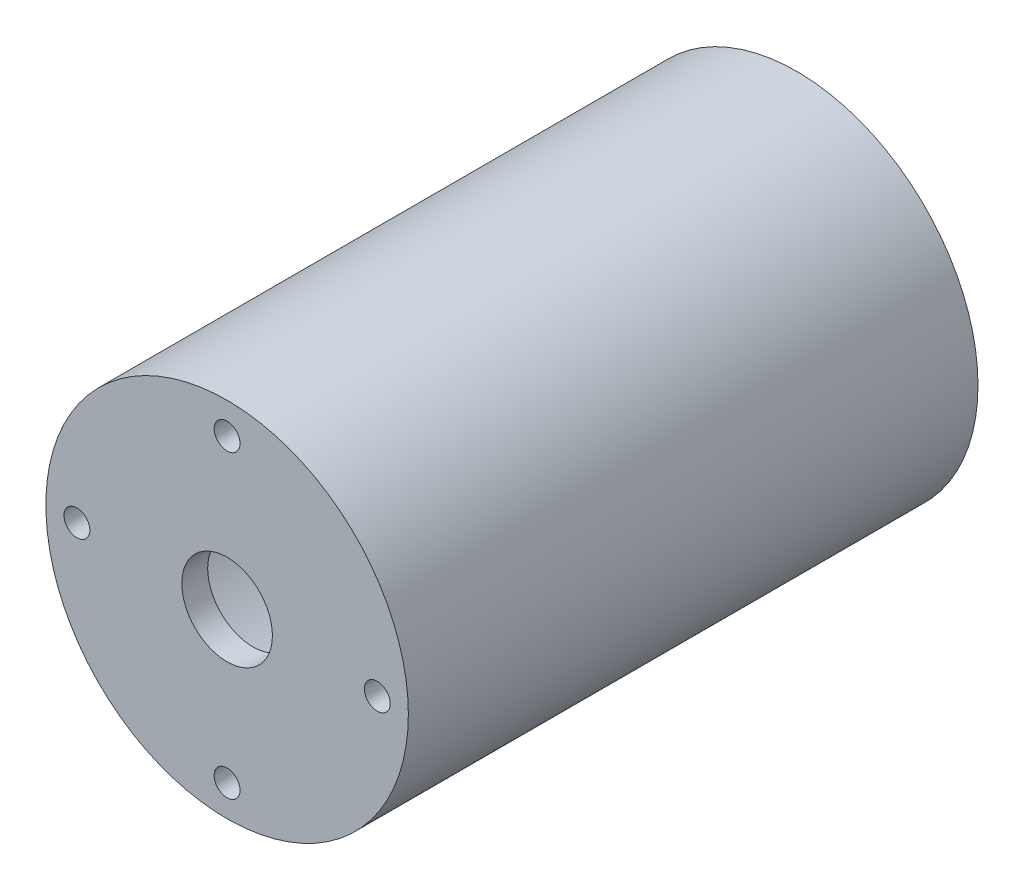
from build123d import *

# Parameters (mm, degrees)
CROQUIS1_R              = 70
SALIENTE_EXTRUIR1_DEPTH = 220
CROQUIS2_R              = 65
CORTAR_EXTRUIR1_DEPTH   = 210
CORTAR_EXTRUIR2_REACH   = 243.247
CROQUIS3_R              = 5
CORTAR_EXTRUIR3_REACH   = 243.247
CROQUIS4_R              = 17.5


with BuildPart() as part:
    # Croquis1 → Saliente-Extruir1 (new body)
    with BuildSketch(Plane.XY):
        Circle(CROQUIS1_R)
    extrude(amount=SALIENTE_EXTRUIR1_DEPTH)

    # Croquis2 → Cortar-Extruir1 (cut)
    with BuildSketch(Plane(origin=(0, 0, 0), x_dir=(-1, 0, 0), z_dir=(0, 0, -1))):
        Circle(CROQUIS2_R)
    extrude(amount=-CORTAR_EXTRUIR1_DEPTH, mode=Mode.SUBTRACT)

    # Croquis3 → Cortar-Extruir2 (cut, up to next)
    with BuildSketch(Plane.XY.offset(220), mode=Mode.PRIVATE) as cortar_extruir2_sk1:
        with Locations((0, 58)):
            Circle(CROQUIS3_R)
    cortar_extruir2_tool1 = extrude(cortar_extruir2_sk1.sketch, amount=-CORTAR_EXTRUIR2_REACH, mode=Mode.PRIVATE) & part.part
    # Croquis3 → Cortar-Extruir2 (cut, up to next)
    with BuildSketch(Plane.XY.offset(220), mode=Mode.PRIVATE) as cortar_extruir2_sk2:
        with Locations((58, 0)):
            Circle(CROQUIS3_R)
    cortar_extruir2_tool2 = extrude(cortar_extruir2_sk2.sketch, amount=-CORTAR_EXTRUIR2_REACH, mode=Mode.PRIVATE) & part.part
    # Croquis3 → Cortar-Extruir2 (cut, up to next)
    with BuildSketch(Plane.XY.offset(220), mode=Mode.PRIVATE) as cortar_extruir2_sk3:
        with Locations((0, -58)):
            Circle(CROQUIS3_R)
    cortar_extruir2_tool3 = extrude(cortar_extruir2_sk3.sketch, amount=-CORTAR_EXTRUIR2_REACH, mode=Mode.PRIVATE) & part.part
    # Croquis3 → Cortar-Extruir2 (cut, up to next)
    with BuildSketch(Plane.XY.offset(220), mode=Mode.PRIVATE) as cortar_extruir2_sk4:
        with Locations((-58, 0)):
            Circle(CROQUIS3_R)
    cortar_extruir2_tool4 = extrude(cortar_extruir2_sk4.sketch, amount=-CORTAR_EXTRUIR2_REACH, mode=Mode.PRIVATE) & part.part
    add(cortar_extruir2_tool1.solids().sort_by_distance((0, 58, 220))[0], mode=Mode.SUBTRACT)
    add(cortar_extruir2_tool2.solids().sort_by_distance((58, 0, 220))[0], mode=Mode.SUBTRACT)
    add(cortar_extruir2_tool3.solids().sort_by_distance((0, -58, 220))[0], mode=Mode.SUBTRACT)
    add(cortar_extruir2_tool4.solids().sort_by_distance((-58, 0, 220))[0], mode=Mode.SUBTRACT)

    # Croquis4 → Cortar-Extruir3 (cut, up to next)
    with BuildSketch(Plane.XY.offset(220), mode=Mode.PRIVATE) as cortar_extruir3_sk1:
        Circle(CROQUIS4_R)
    cortar_extruir3_tool1 = extrude(cortar_extruir3_sk1.sketch, amount=-CORTAR_EXTRUIR3_REACH, mode=Mode.PRIVATE) & part.part
    add(cortar_extruir3_tool1.solids().sort_by_distance((0, 0, 220))[0], mode=Mode.SUBTRACT)


solid = part.part
